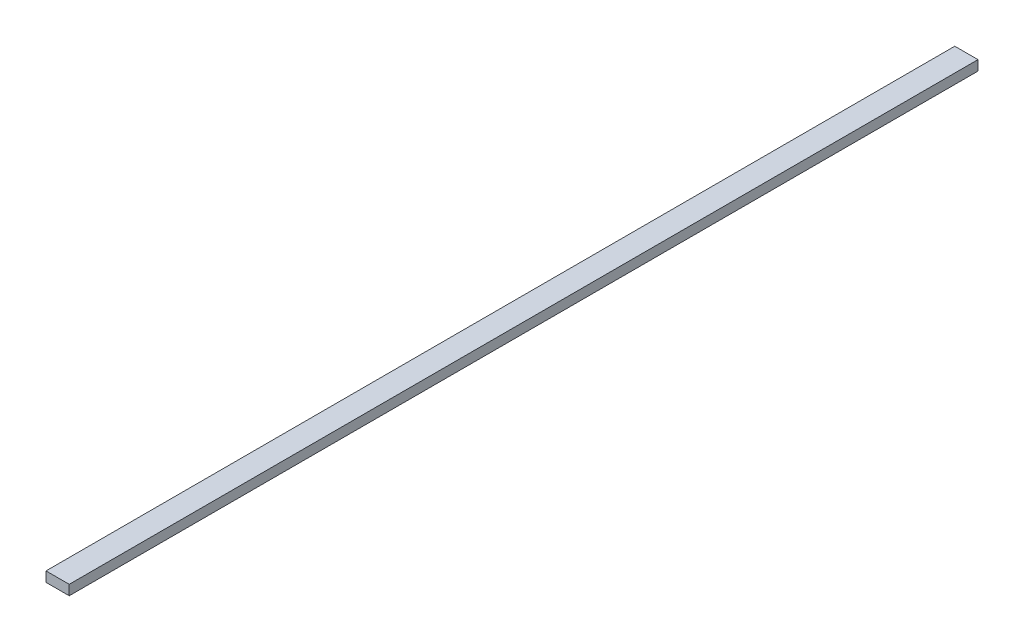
ISO-10303-21;
HEADER;
FILE_DESCRIPTION(('STEP AP214'),'2;1');
FILE_NAME('part.step','',(''),(''),'','','');
FILE_SCHEMA(('AUTOMOTIVE_DESIGN { 1 0 10303 214 1 1 1 1 }'));
ENDSEC;
DATA;
#1=APPLICATION_CONTEXT('core data for automotive mechanical design processes');
#2=APPLICATION_PROTOCOL_DEFINITION('international standard','automotive_design',2000,#1);
#3=PRODUCT_CONTEXT('',#1,'mechanical');
#4=PRODUCT('Part','Part','',(#3));
#5=PRODUCT_RELATED_PRODUCT_CATEGORY('part','',(#4));
#6=PRODUCT_DEFINITION_FORMATION('','',#4);
#7=PRODUCT_DEFINITION_CONTEXT('part definition',#1,'design');
#8=PRODUCT_DEFINITION('design','',#6,#7);
#9=PRODUCT_DEFINITION_SHAPE('','',#8);
#10=(LENGTH_UNIT() NAMED_UNIT(*) SI_UNIT(.MILLI.,.METRE.));
#11=(NAMED_UNIT(*) PLANE_ANGLE_UNIT() SI_UNIT($,.RADIAN.));
#12=(NAMED_UNIT(*) SI_UNIT($,.STERADIAN.) SOLID_ANGLE_UNIT());
#13=UNCERTAINTY_MEASURE_WITH_UNIT(LENGTH_MEASURE(1.E-05),#10,'distance_accuracy_value','');
#14=(GEOMETRIC_REPRESENTATION_CONTEXT(3) GLOBAL_UNCERTAINTY_ASSIGNED_CONTEXT((#13)) GLOBAL_UNIT_ASSIGNED_CONTEXT((#10,
#11,#12)) REPRESENTATION_CONTEXT('',''));
#15=CARTESIAN_POINT('',(0.,0.,0.));
#16=DIRECTION('',(0.,0.,1.));
#17=DIRECTION('',(1.,0.,0.));
#18=AXIS2_PLACEMENT_3D('',#15,#16,#17);
#19=CARTESIAN_POINT('',(-88.9,38.1,0.));
#20=DIRECTION('',(0.,0.,1.));
#21=DIRECTION('',(1.,0.,0.));
#22=AXIS2_PLACEMENT_3D('',#19,#20,#21);
#23=PLANE('',#22);
#24=DIRECTION('',(-1.,0.,0.));
#25=VECTOR('',#24,1.);
#26=CARTESIAN_POINT('',(-88.9,0.,0.));
#27=LINE('',#26,#25);
#28=CARTESIAN_POINT('',(0.,0.,0.));
#29=VERTEX_POINT('',#28);
#30=CARTESIAN_POINT('',(-88.9,0.,0.));
#31=VERTEX_POINT('',#30);
#32=EDGE_CURVE('E96',#29,#31,#27,.T.);
#33=ORIENTED_EDGE('',*,*,#32,.T.);
#34=DIRECTION('',(0.,-1.,0.));
#35=VECTOR('',#34,1.);
#36=CARTESIAN_POINT('',(-88.9,38.1,0.));
#37=LINE('',#36,#35);
#38=CARTESIAN_POINT('',(-88.9,38.1,0.));
#39=VERTEX_POINT('',#38);
#40=EDGE_CURVE('E11',#39,#31,#37,.T.);
#41=ORIENTED_EDGE('',*,*,#40,.F.);
#42=DIRECTION('',(-1.,0.,0.));
#43=VECTOR('',#42,1.);
#44=CARTESIAN_POINT('',(-88.9,38.1,0.));
#45=LINE('',#44,#43);
#46=CARTESIAN_POINT('',(0.,38.1,0.));
#47=VERTEX_POINT('',#46);
#48=EDGE_CURVE('E84',#47,#39,#45,.T.);
#49=ORIENTED_EDGE('',*,*,#48,.F.);
#50=DIRECTION('',(0.,-1.,0.));
#51=VECTOR('',#50,1.);
#52=CARTESIAN_POINT('',(0.,38.1,0.));
#53=LINE('',#52,#51);
#54=EDGE_CURVE('E92',#47,#29,#53,.T.);
#55=ORIENTED_EDGE('',*,*,#54,.T.);
#56=EDGE_LOOP('',(#33,#41,#49,#55));
#57=FACE_BOUND('',#56,.T.);
#58=ADVANCED_FACE('F33',(#57),#23,.F.);
#59=CARTESIAN_POINT('',(-88.9,38.1,3479.8));
#60=DIRECTION('',(1.,0.,0.));
#61=DIRECTION('',(0.,0.,-1.));
#62=AXIS2_PLACEMENT_3D('',#59,#60,#61);
#63=PLANE('',#62);
#64=DIRECTION('',(0.,0.,1.));
#65=VECTOR('',#64,1.);
#66=CARTESIAN_POINT('',(-88.9,0.,3479.8));
#67=LINE('',#66,#65);
#68=CARTESIAN_POINT('',(-88.9,0.,3479.8));
#69=VERTEX_POINT('',#68);
#70=EDGE_CURVE('E88',#31,#69,#67,.T.);
#71=ORIENTED_EDGE('',*,*,#70,.T.);
#72=DIRECTION('',(0.,-1.,0.));
#73=VECTOR('',#72,1.);
#74=CARTESIAN_POINT('',(-88.9,38.1,3479.8));
#75=LINE('',#74,#73);
#76=CARTESIAN_POINT('',(-88.9,38.1,3479.8));
#77=VERTEX_POINT('',#76);
#78=EDGE_CURVE('E41',#77,#69,#75,.T.);
#79=ORIENTED_EDGE('',*,*,#78,.F.);
#80=DIRECTION('',(0.,0.,1.));
#81=VECTOR('',#80,1.);
#82=CARTESIAN_POINT('',(-88.9,38.1,3479.8));
#83=LINE('',#82,#81);
#84=EDGE_CURVE('E79',#39,#77,#83,.T.);
#85=ORIENTED_EDGE('',*,*,#84,.F.);
#86=ORIENTED_EDGE('',*,*,#40,.T.);
#87=EDGE_LOOP('',(#71,#79,#85,#86));
#88=FACE_BOUND('',#87,.T.);
#89=ADVANCED_FACE('F87',(#88),#63,.F.);
#90=CARTESIAN_POINT('',(4.26152593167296E-13,38.1,3479.8));
#91=DIRECTION('',(0.,0.,-1.));
#92=DIRECTION('',(-1.,0.,0.));
#93=AXIS2_PLACEMENT_3D('',#90,#91,#92);
#94=PLANE('',#93);
#95=DIRECTION('',(1.,0.,0.));
#96=VECTOR('',#95,1.);
#97=CARTESIAN_POINT('',(4.26152593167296E-13,0.,3479.8));
#98=LINE('',#97,#96);
#99=CARTESIAN_POINT('',(4.26152593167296E-13,0.,3479.8));
#100=VERTEX_POINT('',#99);
#101=EDGE_CURVE('E66',#69,#100,#98,.T.);
#102=ORIENTED_EDGE('',*,*,#101,.T.);
#103=DIRECTION('',(0.,-1.,0.));
#104=VECTOR('',#103,1.);
#105=CARTESIAN_POINT('',(4.26152593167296E-13,38.1,3479.8));
#106=LINE('',#105,#104);
#107=CARTESIAN_POINT('',(4.26152593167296E-13,38.1,3479.8));
#108=VERTEX_POINT('',#107);
#109=EDGE_CURVE('E89',#108,#100,#106,.T.);
#110=ORIENTED_EDGE('',*,*,#109,.F.);
#111=DIRECTION('',(1.,0.,0.));
#112=VECTOR('',#111,1.);
#113=CARTESIAN_POINT('',(4.26152593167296E-13,38.1,3479.8));
#114=LINE('',#113,#112);
#115=EDGE_CURVE('E82',#77,#108,#114,.T.);
#116=ORIENTED_EDGE('',*,*,#115,.F.);
#117=ORIENTED_EDGE('',*,*,#78,.T.);
#118=EDGE_LOOP('',(#102,#110,#116,#117));
#119=FACE_BOUND('',#118,.T.);
#120=ADVANCED_FACE('F90',(#119),#94,.F.);
#121=CARTESIAN_POINT('',(0.,38.1,0.));
#122=DIRECTION('',(-1.,0.,0.));
#123=DIRECTION('',(0.,0.,1.));
#124=AXIS2_PLACEMENT_3D('',#121,#122,#123);
#125=PLANE('',#124);
#126=DIRECTION('',(0.,0.,-1.));
#127=VECTOR('',#126,1.);
#128=CARTESIAN_POINT('',(0.,0.,0.));
#129=LINE('',#128,#127);
#130=EDGE_CURVE('E72',#100,#29,#129,.T.);
#131=ORIENTED_EDGE('',*,*,#130,.T.);
#132=ORIENTED_EDGE('',*,*,#54,.F.);
#133=DIRECTION('',(0.,0.,-1.));
#134=VECTOR('',#133,1.);
#135=CARTESIAN_POINT('',(0.,38.1,0.));
#136=LINE('',#135,#134);
#137=EDGE_CURVE('E49',#108,#47,#136,.T.);
#138=ORIENTED_EDGE('',*,*,#137,.F.);
#139=ORIENTED_EDGE('',*,*,#109,.T.);
#140=EDGE_LOOP('',(#131,#132,#138,#139));
#141=FACE_BOUND('',#140,.T.);
#142=ADVANCED_FACE('F103',(#141),#125,.F.);
#143=CARTESIAN_POINT('',(0.,38.1,0.));
#144=DIRECTION('',(0.,-1.,0.));
#145=DIRECTION('',(0.,0.,-1.));
#146=AXIS2_PLACEMENT_3D('',#143,#144,#145);
#147=PLANE('',#146);
#148=ORIENTED_EDGE('',*,*,#48,.T.);
#149=ORIENTED_EDGE('',*,*,#84,.T.);
#150=ORIENTED_EDGE('',*,*,#115,.T.);
#151=ORIENTED_EDGE('',*,*,#137,.T.);
#152=EDGE_LOOP('',(#148,#149,#150,#151));
#153=FACE_BOUND('',#152,.T.);
#154=ADVANCED_FACE('F80',(#153),#147,.F.);
#155=CARTESIAN_POINT('',(0.,0.,0.));
#156=DIRECTION('',(0.,-1.,0.));
#157=DIRECTION('',(0.,0.,-1.));
#158=AXIS2_PLACEMENT_3D('',#155,#156,#157);
#159=PLANE('',#158);
#160=ORIENTED_EDGE('',*,*,#32,.F.);
#161=ORIENTED_EDGE('',*,*,#130,.F.);
#162=ORIENTED_EDGE('',*,*,#101,.F.);
#163=ORIENTED_EDGE('',*,*,#70,.F.);
#164=EDGE_LOOP('',(#160,#161,#162,#163));
#165=FACE_BOUND('',#164,.T.);
#166=ADVANCED_FACE('F106',(#165),#159,.T.);
#167=CLOSED_SHELL('',(#58,#89,#120,#142,#154,#166));
#168=MANIFOLD_SOLID_BREP('B2',#167);
#169=ADVANCED_BREP_SHAPE_REPRESENTATION('',(#18,#168),#14);
#170=SHAPE_DEFINITION_REPRESENTATION(#9,#169);
ENDSEC;
END-ISO-10303-21;
